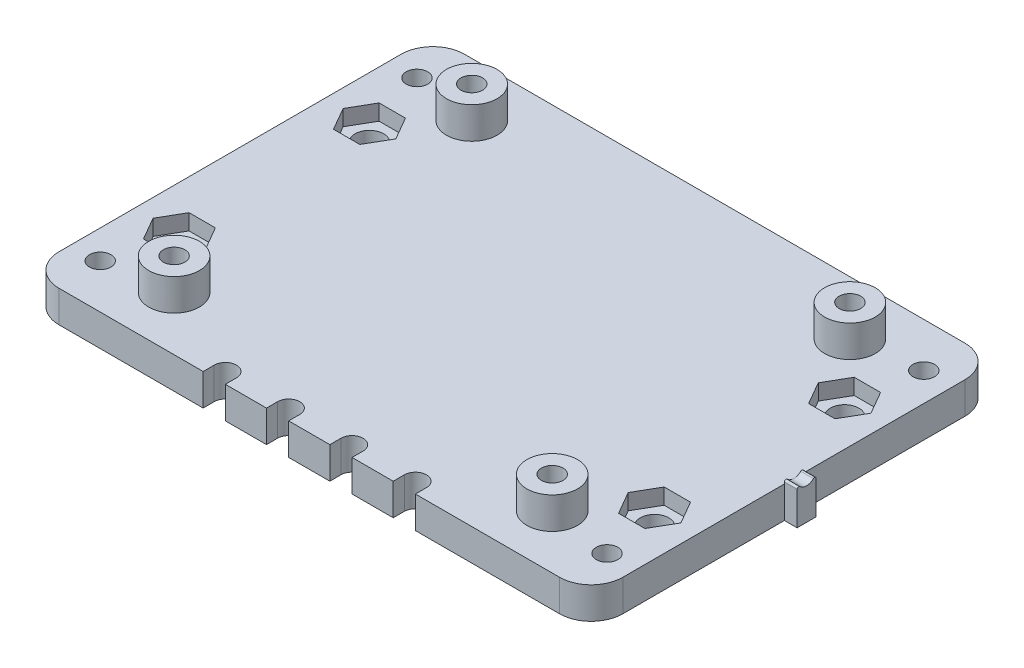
from build123d import *

# Parameters (mm, degrees)
SKETCH1_W            = 89
SKETCH1_H            = 64
BOSS_EXTRUDE1_DEPTH  = 5
SKETCH3_R            = 4
BOSS_EXTRUDE2_DEPTH  = 5
CUT_EXTRUDE1_DEPTH   = 5
CUT_EXTRUDE2_DEPTH   = 2.5
M4_CLEARANCE_HOLE1_D = 4.5
M3_CLEARANCE_HOLE1_D = 3.4
CUT_EXTRUDE3_DEPTH   = 2.5
CUT_EXTRUDE4_DEPTH   = 2.5
M3_CLEARANCE_HOLE2_D = 3.4
BOSS_EXTRUDE3_DEPTH  = 2
FILLET1_R            = 0.25
FILLET2_R            = 5


with BuildPart() as part:
    # Sketch1 → Boss-Extrude1 (new body)
    with BuildSketch(Plane(origin=(0, 0, 0), x_dir=(1, 0, 0), z_dir=(0, 1, 0))):
        Rectangle(SKETCH1_W, SKETCH1_H)
    extrude(amount=BOSS_EXTRUDE1_DEPTH)

    # Sketch3 → Boss-Extrude2 (add)
    with BuildSketch(Plane(origin=(0, 5, 0), x_dir=(1, 0, 0), z_dir=(0, 1, 0))):
        with Locations(Location((-29.845, 23.495, 0), (0, 0, 90))):
            Circle(SKETCH3_R)
        with Locations(Location((29.845, 23.495, 0), (0, 0, 90))):
            Circle(SKETCH3_R)
        with Locations(Location((-29.845, -23.495, 0), (0, 0, 90))):
            Circle(SKETCH3_R)
        with Locations(Location((29.845, -23.495, 0), (0, 0, 90))):
            Circle(SKETCH3_R)
    extrude(amount=BOSS_EXTRUDE2_DEPTH)

    # Sketch4 → Cut-Extrude1 (cut)
    with BuildSketch(Plane(origin=(0, 5, 0), x_dir=(1, 0, 0), z_dir=(0, 1, 0))):
        with BuildLine():
            Line((-16.75, -30.25), (-16.75, -32))
            Line((-16.75, -32), (-13.25, -32))
            Line((-13.25, -32), (-13.25, -30.25))
            ThreePointArc((-13.25, -30.25), (-15, -28.5), (-16.75, -30.25))
        make_face()
        with BuildLine():
            Line((-3.25, -32), (-3.25, -30.25))
            ThreePointArc((-3.25, -30.25), (-5, -28.5), (-6.75, -30.25))
            Line((-6.75, -30.25), (-6.75, -32))
            Line((-6.75, -32), (-3.25, -32))
        make_face()
        with BuildLine():
            Line((6.75, -32), (6.75, -30.25))
            ThreePointArc((6.75, -30.25), (5, -28.5), (3.25, -30.25))
            Line((3.25, -30.25), (3.25, -32))
            Line((3.25, -32), (6.75, -32))
        make_face()
        with BuildLine():
            Line((16.75, -32), (16.75, -30.25))
            ThreePointArc((16.75, -30.25), (15, -28.5), (13.25, -30.25))
            Line((13.25, -30.25), (13.25, -32))
            Line((13.25, -32), (16.75, -32))
        make_face()
    extrude(amount=-CUT_EXTRUDE1_DEPTH, mode=Mode.SUBTRACT)

    # Sketch6 → Cut-Extrude2 (cut)
    with BuildSketch(Plane(origin=(0, 5, 0), x_dir=(1, 0, 0), z_dir=(0, 1, 0))):
        Polygon((-33.343078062, 15), (-35.421539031, 18.6), (-39.578460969, 18.6), (-41.656921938, 15), (-39.578460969, 11.4), (-35.421539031, 11.4), align=None)
        Polygon((-33.343078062, -15), (-35.421539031, -11.4), (-39.578460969, -11.4), (-41.656921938, -15), (-39.578460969, -18.6), (-35.421539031, -18.6), align=None)
        Polygon((41.656921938, -15), (39.578460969, -11.4), (35.421539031, -11.4), (33.343078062, -15), (35.421539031, -18.6), (39.578460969, -18.6), align=None)
        Polygon((41.656921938, 15), (39.578460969, 18.6), (35.421539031, 18.6), (33.343078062, 15), (35.421539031, 11.4), (39.578460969, 11.4), align=None)
    extrude(amount=-CUT_EXTRUDE2_DEPTH, mode=Mode.SUBTRACT)

    # M4 Clearance Hole1 (through all)
    with Locations(Plane(origin=(0, 5, 0), x_dir=(1, 0, 0), z_dir=(0, 1, 0))):
        with Locations((-37.5, 15), (37.5, 15), (37.5, -15), (-37.5, -15)):
            Hole(M4_CLEARANCE_HOLE1_D / 2)

    # M3 Clearance Hole1 (through all)
    with Locations(Plane(origin=(0, 10, 0), x_dir=(1, 0, 0), z_dir=(0, 1, 0))):
        with Locations((-29.845, 23.495), (29.845, 23.495), (29.845, -23.495), (-29.845, -23.495)):
            Hole(M3_CLEARANCE_HOLE1_D / 2)

    # Sketch11 → Cut-Extrude3 (cut)
    with BuildSketch(Plane.XZ):
        Polygon((26.525235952, -23.495), (28.185117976, -26.37), (31.504882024, -26.37), (33.164764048, -23.495), (31.504882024, -20.62), (28.185117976, -20.62), align=None)
        Polygon((-33.164764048, -23.495), (-31.504882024, -26.37), (-28.185117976, -26.37), (-26.525235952, -23.495), (-28.185117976, -20.62), (-31.504882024, -20.62), align=None)
        Polygon((-33.164764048, 23.495), (-31.504882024, 20.62), (-28.185117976, 20.62), (-26.525235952, 23.495), (-28.185117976, 26.37), (-31.504882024, 26.37), align=None)
        Polygon((26.525235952, 23.495), (28.185117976, 20.62), (31.504882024, 20.62), (33.164764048, 23.495), (31.504882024, 26.37), (28.185117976, 26.37), align=None)
    extrude(amount=-CUT_EXTRUDE3_DEPTH, mode=Mode.SUBTRACT)

    # Sketch13 → Cut-Extrude4 (cut)
    with BuildSketch(Plane.XZ):
        Polygon((40, -28.319764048), (42.875, -26.659882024), (42.875, -23.340117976), (40, -21.680235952), (37.125, -23.340117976), (37.125, -26.659882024), align=None)
        Polygon((40, 21.680235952), (42.875, 23.340117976), (42.875, 26.659882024), (40, 28.319764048), (37.125, 26.659882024), (37.125, 23.340117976), align=None)
        Polygon((-40, 21.680235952), (-37.125, 23.340117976), (-37.125, 26.659882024), (-40, 28.319764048), (-42.875, 26.659882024), (-42.875, 23.340117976), align=None)
        Polygon((-40, -28.319764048), (-37.125, -26.659882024), (-37.125, -23.340117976), (-40, -21.680235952), (-42.875, -23.340117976), (-42.875, -26.659882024), align=None)
    extrude(amount=-CUT_EXTRUDE4_DEPTH, mode=Mode.SUBTRACT)

    # M3 Clearance Hole2 (through all)
    with Locations(Plane(origin=(0, 0, 0), x_dir=(-1, 0, 0), z_dir=(0, -1, 0))):
        with Locations((40, 25), (40, -25), (-40, -25), (-40, 25)):
            Hole(M3_CLEARANCE_HOLE2_D / 2)

    # Sketch18 → Boss-Extrude3 (add)
    with BuildSketch(Plane(origin=(44.5, 0, 0), x_dir=(0, 0, -1), z_dir=(1, 0, 0))):
        with BuildLine():
            Line((-1.5, 6.5), (-1.5, 0))
            Line((-1.5, 0), (1.5, 0))
            Line((1.5, 0), (1.5, 6.5))
            ThreePointArc((1.5, 6.5), (0, 5), (-1.5, 6.5))
        make_face()
    extrude(amount=BOSS_EXTRUDE3_DEPTH)

    # Fillet1
    fillet1_edges = [part.edges().sort_by_distance(p)[0] for p in [
        (45.5, 6.5, -1.5),
        (45.5, 6.5, 1.5),
    ]]
    fillet(fillet1_edges, radius=FILLET1_R)

    # Fillet2
    fillet2_edges = [part.edges().sort_by_distance(p)[0] for p in [
        (44.5, 2.5, 32),
        (-44.5, 2.5, 32),
        (-44.5, 2.5, -32),
        (44.5, 2.5, -32),
    ]]
    fillet(fillet2_edges, radius=FILLET2_R)


solid = part.part
